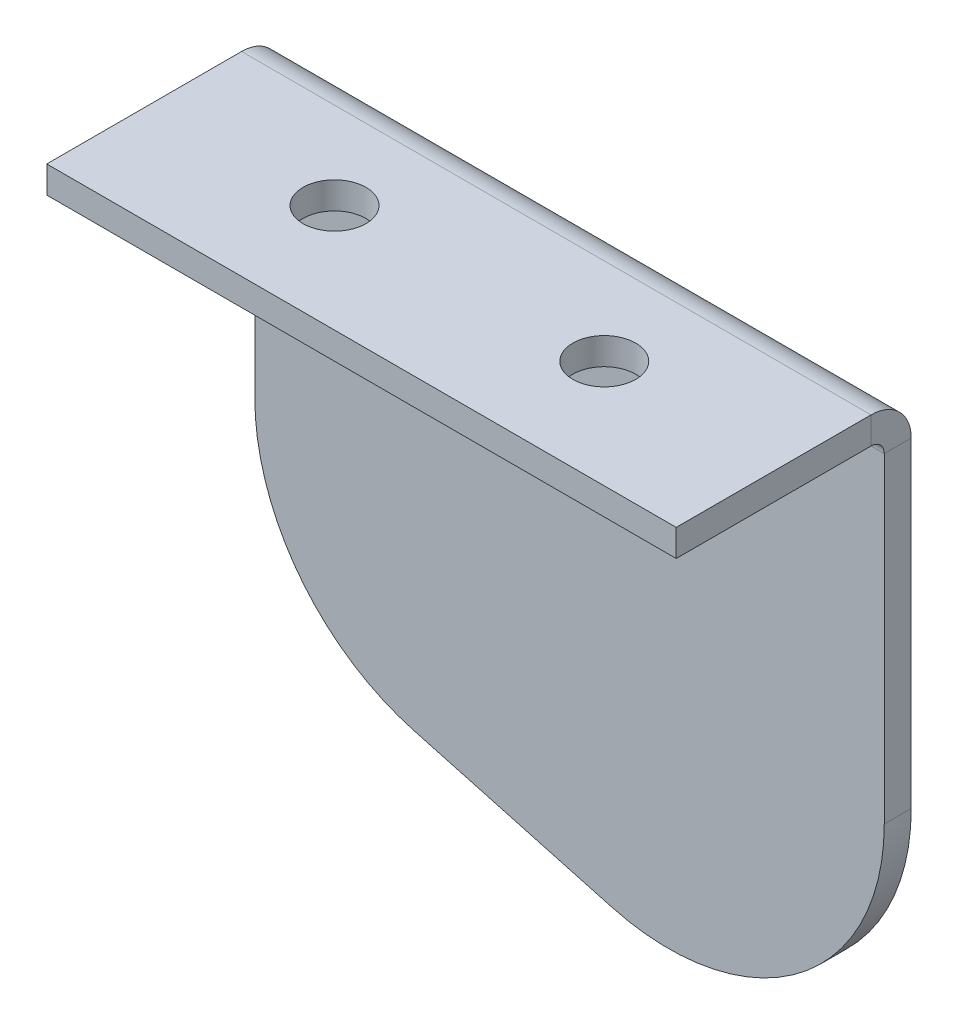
ISO-10303-21;
HEADER;
FILE_DESCRIPTION(('STEP AP214'),'2;1');
FILE_NAME('part.step','',(''),(''),'','','');
FILE_SCHEMA(('AUTOMOTIVE_DESIGN { 1 0 10303 214 1 1 1 1 }'));
ENDSEC;
DATA;
#1=APPLICATION_CONTEXT('core data for automotive mechanical design processes');
#2=APPLICATION_PROTOCOL_DEFINITION('international standard','automotive_design',2000,#1);
#3=PRODUCT_CONTEXT('',#1,'mechanical');
#4=PRODUCT('Part','Part','',(#3));
#5=PRODUCT_RELATED_PRODUCT_CATEGORY('part','',(#4));
#6=PRODUCT_DEFINITION_FORMATION('','',#4);
#7=PRODUCT_DEFINITION_CONTEXT('part definition',#1,'design');
#8=PRODUCT_DEFINITION('design','',#6,#7);
#9=PRODUCT_DEFINITION_SHAPE('','',#8);
#10=(LENGTH_UNIT() NAMED_UNIT(*) SI_UNIT(.MILLI.,.METRE.));
#11=(NAMED_UNIT(*) PLANE_ANGLE_UNIT() SI_UNIT($,.RADIAN.));
#12=(NAMED_UNIT(*) SI_UNIT($,.STERADIAN.) SOLID_ANGLE_UNIT());
#13=UNCERTAINTY_MEASURE_WITH_UNIT(LENGTH_MEASURE(1.E-05),#10,'distance_accuracy_value','');
#14=(GEOMETRIC_REPRESENTATION_CONTEXT(3) GLOBAL_UNCERTAINTY_ASSIGNED_CONTEXT((#13)) GLOBAL_UNIT_ASSIGNED_CONTEXT((#10,
#11,#12)) REPRESENTATION_CONTEXT('',''));
#15=CARTESIAN_POINT('',(0.,0.,0.));
#16=DIRECTION('',(0.,0.,1.));
#17=DIRECTION('',(1.,0.,0.));
#18=AXIS2_PLACEMENT_3D('',#15,#16,#17);
#19=CARTESIAN_POINT('',(35.,12.4309729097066,-13.0690270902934));
#20=DIRECTION('',(-1.,0.,0.));
#21=DIRECTION('',(0.,1.,0.));
#22=AXIS2_PLACEMENT_3D('',#19,#20,#21);
#23=PLANE('',#22);
#24=DIRECTION('',(0.,-1.,0.));
#25=VECTOR('',#24,1.);
#26=CARTESIAN_POINT('',(35.,12.4309729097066,-13.0690270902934));
#27=LINE('',#26,#25);
#28=CARTESIAN_POINT('',(35.,-0.736600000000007,-13.0690270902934));
#29=VERTEX_POINT('',#28);
#30=CARTESIAN_POINT('',(35.,-18.5690270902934,-13.0690270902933));
#31=VERTEX_POINT('',#30);
#32=EDGE_CURVE('E51',#29,#31,#27,.T.);
#33=ORIENTED_EDGE('',*,*,#32,.F.);
#34=DIRECTION('',(0.,0.,1.));
#35=VECTOR('',#34,1.);
#36=CARTESIAN_POINT('',(35.,-0.736600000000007,-13.0690270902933));
#37=LINE('',#36,#35);
#38=CARTESIAN_POINT('',(35.,-0.736600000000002,-11.5690270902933));
#39=VERTEX_POINT('',#38);
#40=EDGE_CURVE('E14',#29,#39,#37,.T.);
#41=ORIENTED_EDGE('',*,*,#40,.T.);
#42=DIRECTION('',(0.,-1.,0.));
#43=VECTOR('',#42,1.);
#44=CARTESIAN_POINT('',(35.,12.4309729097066,-11.5690270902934));
#45=LINE('',#44,#43);
#46=CARTESIAN_POINT('',(35.,-18.5690270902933,-11.5690270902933));
#47=VERTEX_POINT('',#46);
#48=EDGE_CURVE('E64',#39,#47,#45,.T.);
#49=ORIENTED_EDGE('',*,*,#48,.T.);
#50=DIRECTION('',(0.,0.,1.));
#51=VECTOR('',#50,1.);
#52=CARTESIAN_POINT('',(35.,-18.5690270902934,-13.0690270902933));
#53=LINE('',#52,#51);
#54=EDGE_CURVE('E215',#31,#47,#53,.T.);
#55=ORIENTED_EDGE('',*,*,#54,.F.);
#56=EDGE_LOOP('',(#33,#41,#49,#55));
#57=FACE_BOUND('',#56,.T.);
#58=ADVANCED_FACE('F48',(#57),#23,.F.);
#59=CARTESIAN_POINT('',(0.,-15.5690270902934,-13.0690270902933));
#60=DIRECTION('',(1.,0.,0.));
#61=DIRECTION('',(0.,-1.,0.));
#62=AXIS2_PLACEMENT_3D('',#59,#60,#61);
#63=PLANE('',#62);
#64=DIRECTION('',(0.,1.,0.));
#65=VECTOR('',#64,1.);
#66=CARTESIAN_POINT('',(0.,-15.5690270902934,-11.5690270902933));
#67=LINE('',#66,#65);
#68=CARTESIAN_POINT('',(0.,-15.5690270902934,-11.5690270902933));
#69=VERTEX_POINT('',#68);
#70=CARTESIAN_POINT('',(0.,-0.736600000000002,-11.5690270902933));
#71=VERTEX_POINT('',#70);
#72=EDGE_CURVE('E71',#69,#71,#67,.T.);
#73=ORIENTED_EDGE('',*,*,#72,.T.);
#74=DIRECTION('',(0.,0.,-1.));
#75=VECTOR('',#74,1.);
#76=CARTESIAN_POINT('',(0.,-0.736600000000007,-13.0690270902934));
#77=LINE('',#76,#75);
#78=CARTESIAN_POINT('',(0.,-0.736600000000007,-13.069027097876));
#79=VERTEX_POINT('',#78);
#80=EDGE_CURVE('E221',#71,#79,#77,.T.);
#81=ORIENTED_EDGE('',*,*,#80,.T.);
#82=DIRECTION('',(0.,1.,0.));
#83=VECTOR('',#82,1.);
#84=CARTESIAN_POINT('',(0.,-15.5690270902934,-13.0690270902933));
#85=LINE('',#84,#83);
#86=CARTESIAN_POINT('',(0.,-15.5690270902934,-13.0690270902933));
#87=VERTEX_POINT('',#86);
#88=EDGE_CURVE('E204',#87,#79,#85,.T.);
#89=ORIENTED_EDGE('',*,*,#88,.F.);
#90=DIRECTION('',(0.,0.,1.));
#91=VECTOR('',#90,1.);
#92=CARTESIAN_POINT('',(0.,-15.5690270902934,-13.0690270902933));
#93=LINE('',#92,#91);
#94=EDGE_CURVE('E218',#87,#69,#93,.T.);
#95=ORIENTED_EDGE('',*,*,#94,.T.);
#96=EDGE_LOOP('',(#73,#81,#89,#95));
#97=FACE_BOUND('',#96,.T.);
#98=ADVANCED_FACE('F246',(#97),#63,.F.);
#99=CARTESIAN_POINT('',(12.,-15.5690270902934,-11.5690270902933));
#100=DIRECTION('',(0.,0.,-1.));
#101=DIRECTION('',(0.,1.,0.));
#102=AXIS2_PLACEMENT_3D('',#99,#100,#101);
#103=PLANE('',#102);
#104=ORIENTED_EDGE('',*,*,#48,.F.);
#105=DIRECTION('',(-1.,0.,0.));
#106=VECTOR('',#105,1.);
#107=CARTESIAN_POINT('',(12.,-0.736600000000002,-11.5690270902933));
#108=LINE('',#107,#106);
#109=EDGE_CURVE('E56',#39,#71,#108,.T.);
#110=ORIENTED_EDGE('',*,*,#109,.T.);
#111=ORIENTED_EDGE('',*,*,#72,.F.);
#112=CARTESIAN_POINT('',(12.,-15.5690270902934,-11.5690270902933));
#113=DIRECTION('',(0.,0.,-1.));
#114=DIRECTION('',(0.,1.,0.));
#115=AXIS2_PLACEMENT_3D('',#112,#113,#114);
#116=CIRCLE('',#115,12.);
#117=CARTESIAN_POINT('',(8.8425911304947,-27.1461929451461,-11.5690270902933));
#118=VERTEX_POINT('',#117);
#119=EDGE_CURVE('E172',#118,#69,#116,.T.);
#120=ORIENTED_EDGE('',*,*,#119,.F.);
#121=DIRECTION('',(-0.964763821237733,0.263117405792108,0.));
#122=VECTOR('',#121,1.);
#123=CARTESIAN_POINT('',(8.8425911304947,-27.1461929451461,-11.5690270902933));
#124=LINE('',#123,#122);
#125=CARTESIAN_POINT('',(19.8425911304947,-30.1461929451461,-11.5690270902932));
#126=VERTEX_POINT('',#125);
#127=EDGE_CURVE('E199',#126,#118,#124,.T.);
#128=ORIENTED_EDGE('',*,*,#127,.F.);
#129=CARTESIAN_POINT('',(23.,-18.5690270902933,-11.5690270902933));
#130=DIRECTION('',(0.,0.,-1.));
#131=DIRECTION('',(0.,1.,0.));
#132=AXIS2_PLACEMENT_3D('',#129,#130,#131);
#133=CIRCLE('',#132,12.);
#134=EDGE_CURVE('E197',#47,#126,#133,.T.);
#135=ORIENTED_EDGE('',*,*,#134,.F.);
#136=EDGE_LOOP('',(#104,#110,#111,#120,#128,#135));
#137=FACE_BOUND('',#136,.T.);
#138=ADVANCED_FACE('F283',(#137),#103,.F.);
#139=CARTESIAN_POINT('',(12.,-15.5690270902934,-13.0690270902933));
#140=DIRECTION('',(0.,0.,-1.));
#141=DIRECTION('',(0.,1.,0.));
#142=AXIS2_PLACEMENT_3D('',#139,#140,#141);
#143=PLANE('',#142);
#144=DIRECTION('',(-1.,0.,0.));
#145=VECTOR('',#144,1.);
#146=CARTESIAN_POINT('',(12.,-0.736600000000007,-13.0690270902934));
#147=LINE('',#146,#145);
#148=EDGE_CURVE('E161',#29,#79,#147,.T.);
#149=ORIENTED_EDGE('',*,*,#148,.F.);
#150=ORIENTED_EDGE('',*,*,#32,.T.);
#151=CARTESIAN_POINT('',(23.,-18.5690270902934,-13.0690270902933));
#152=DIRECTION('',(0.,0.,-1.));
#153=DIRECTION('',(0.,1.,0.));
#154=AXIS2_PLACEMENT_3D('',#151,#152,#153);
#155=CIRCLE('',#154,12.);
#156=CARTESIAN_POINT('',(19.8425911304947,-30.1461929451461,-13.0690270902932));
#157=VERTEX_POINT('',#156);
#158=EDGE_CURVE('E205',#31,#157,#155,.T.);
#159=ORIENTED_EDGE('',*,*,#158,.T.);
#160=DIRECTION('',(-0.964763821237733,0.263117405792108,0.));
#161=VECTOR('',#160,1.);
#162=CARTESIAN_POINT('',(8.8425911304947,-27.1461929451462,-13.0690270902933));
#163=LINE('',#162,#161);
#164=CARTESIAN_POINT('',(8.8425911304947,-27.1461929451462,-13.0690270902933));
#165=VERTEX_POINT('',#164);
#166=EDGE_CURVE('E207',#157,#165,#163,.T.);
#167=ORIENTED_EDGE('',*,*,#166,.T.);
#168=CARTESIAN_POINT('',(12.,-15.5690270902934,-13.0690270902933));
#169=DIRECTION('',(0.,0.,-1.));
#170=DIRECTION('',(0.,1.,0.));
#171=AXIS2_PLACEMENT_3D('',#168,#169,#170);
#172=CIRCLE('',#171,12.);
#173=EDGE_CURVE('E201',#165,#87,#172,.T.);
#174=ORIENTED_EDGE('',*,*,#173,.T.);
#175=ORIENTED_EDGE('',*,*,#88,.T.);
#176=EDGE_LOOP('',(#149,#150,#159,#167,#174,#175));
#177=FACE_BOUND('',#176,.T.);
#178=ADVANCED_FACE('F229',(#177),#143,.T.);
#179=CARTESIAN_POINT('',(12.,-15.5690270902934,-13.0690270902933));
#180=DIRECTION('',(0.,0.,1.));
#181=DIRECTION('',(0.,-1.,0.));
#182=AXIS2_PLACEMENT_3D('',#179,#180,#181);
#183=CYLINDRICAL_SURFACE('',#182,12.);
#184=ORIENTED_EDGE('',*,*,#119,.T.);
#185=ORIENTED_EDGE('',*,*,#94,.F.);
#186=ORIENTED_EDGE('',*,*,#173,.F.);
#187=DIRECTION('',(0.,0.,1.));
#188=VECTOR('',#187,1.);
#189=CARTESIAN_POINT('',(8.8425911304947,-27.1461929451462,-13.0690270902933));
#190=LINE('',#189,#188);
#191=EDGE_CURVE('E209',#165,#118,#190,.T.);
#192=ORIENTED_EDGE('',*,*,#191,.T.);
#193=EDGE_LOOP('',(#184,#185,#186,#192));
#194=FACE_BOUND('',#193,.T.);
#195=ADVANCED_FACE('F244',(#194),#183,.T.);
#196=CARTESIAN_POINT('',(23.,-18.5690270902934,-13.0690270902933));
#197=DIRECTION('',(0.,0.,1.));
#198=DIRECTION('',(0.,-1.,0.));
#199=AXIS2_PLACEMENT_3D('',#196,#197,#198);
#200=CYLINDRICAL_SURFACE('',#199,12.);
#201=ORIENTED_EDGE('',*,*,#134,.T.);
#202=DIRECTION('',(0.,0.,1.));
#203=VECTOR('',#202,1.);
#204=CARTESIAN_POINT('',(19.8425911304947,-30.1461929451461,-13.0690270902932));
#205=LINE('',#204,#203);
#206=EDGE_CURVE('E212',#157,#126,#205,.T.);
#207=ORIENTED_EDGE('',*,*,#206,.F.);
#208=ORIENTED_EDGE('',*,*,#158,.F.);
#209=ORIENTED_EDGE('',*,*,#54,.T.);
#210=EDGE_LOOP('',(#201,#207,#208,#209));
#211=FACE_BOUND('',#210,.T.);
#212=ADVANCED_FACE('F235',(#211),#200,.T.);
#213=CARTESIAN_POINT('',(8.8425911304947,-27.1461929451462,-13.0690270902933));
#214=DIRECTION('',(0.263117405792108,0.964763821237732,0.));
#215=DIRECTION('',(0.964763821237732,-0.263117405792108,0.));
#216=AXIS2_PLACEMENT_3D('',#213,#214,#215);
#217=PLANE('',#216);
#218=ORIENTED_EDGE('',*,*,#127,.T.);
#219=ORIENTED_EDGE('',*,*,#191,.F.);
#220=ORIENTED_EDGE('',*,*,#166,.F.);
#221=ORIENTED_EDGE('',*,*,#206,.T.);
#222=EDGE_LOOP('',(#218,#219,#220,#221));
#223=FACE_BOUND('',#222,.T.);
#224=ADVANCED_FACE('F240',(#223),#217,.F.);
#225=CARTESIAN_POINT('',(0.,1.5,0.));
#226=DIRECTION('',(0.,0.,-1.));
#227=DIRECTION('',(-1.,0.,0.));
#228=AXIS2_PLACEMENT_3D('',#225,#226,#227);
#229=PLANE('',#228);
#230=DIRECTION('',(1.,0.,0.));
#231=VECTOR('',#230,1.);
#232=CARTESIAN_POINT('',(0.,0.,0.));
#233=LINE('',#232,#231);
#234=CARTESIAN_POINT('',(0.,0.,0.));
#235=VERTEX_POINT('',#234);
#236=CARTESIAN_POINT('',(35.,0.,0.));
#237=VERTEX_POINT('',#236);
#238=EDGE_CURVE('E156',#235,#237,#233,.T.);
#239=ORIENTED_EDGE('',*,*,#238,.T.);
#240=DIRECTION('',(0.,-1.,0.));
#241=VECTOR('',#240,1.);
#242=CARTESIAN_POINT('',(35.,1.5,0.));
#243=LINE('',#242,#241);
#244=CARTESIAN_POINT('',(35.,1.5,0.));
#245=VERTEX_POINT('',#244);
#246=EDGE_CURVE('E173',#245,#237,#243,.T.);
#247=ORIENTED_EDGE('',*,*,#246,.F.);
#248=DIRECTION('',(1.,0.,0.));
#249=VECTOR('',#248,1.);
#250=CARTESIAN_POINT('',(0.,1.5,0.));
#251=LINE('',#250,#249);
#252=CARTESIAN_POINT('',(0.,1.5,0.));
#253=VERTEX_POINT('',#252);
#254=EDGE_CURVE('E135',#253,#245,#251,.T.);
#255=ORIENTED_EDGE('',*,*,#254,.F.);
#256=DIRECTION('',(0.,-1.,0.));
#257=VECTOR('',#256,1.);
#258=CARTESIAN_POINT('',(0.,1.5,0.));
#259=LINE('',#258,#257);
#260=EDGE_CURVE('E132',#253,#235,#259,.T.);
#261=ORIENTED_EDGE('',*,*,#260,.T.);
#262=EDGE_LOOP('',(#239,#247,#255,#261));
#263=FACE_BOUND('',#262,.T.);
#264=ADVANCED_FACE('F266',(#263),#229,.F.);
#265=CARTESIAN_POINT('',(10.,1.5,-6.));
#266=DIRECTION('',(0.,-1.,0.));
#267=DIRECTION('',(0.,0.,-1.));
#268=AXIS2_PLACEMENT_3D('',#265,#266,#267);
#269=CYLINDRICAL_SURFACE('',#268,1.75);
#270=CARTESIAN_POINT('',(10.,1.5,-6.));
#271=DIRECTION('',(0.,1.,0.));
#272=DIRECTION('',(0.,0.,1.));
#273=AXIS2_PLACEMENT_3D('',#270,#271,#272);
#274=CIRCLE('',#273,1.75);
#275=CARTESIAN_POINT('',(10.,1.5,-4.25));
#276=VERTEX_POINT('',#275);
#277=EDGE_CURVE('E189',#276,#276,#274,.T.);
#278=ORIENTED_EDGE('',*,*,#277,.T.);
#279=EDGE_LOOP('',(#278));
#280=FACE_BOUND('',#279,.T.);
#281=CARTESIAN_POINT('',(10.,0.,-6.));
#282=DIRECTION('',(0.,1.,0.));
#283=DIRECTION('',(0.,0.,1.));
#284=AXIS2_PLACEMENT_3D('',#281,#282,#283);
#285=CIRCLE('',#284,1.75);
#286=CARTESIAN_POINT('',(10.,0.,-4.25));
#287=VERTEX_POINT('',#286);
#288=EDGE_CURVE('E176',#287,#287,#285,.T.);
#289=ORIENTED_EDGE('',*,*,#288,.F.);
#290=EDGE_LOOP('',(#289));
#291=FACE_BOUND('',#290,.T.);
#292=ADVANCED_FACE('F268',(#280,#291),#269,.F.);
#293=CARTESIAN_POINT('',(25.,1.5,-6.));
#294=DIRECTION('',(0.,-1.,0.));
#295=DIRECTION('',(0.,0.,-1.));
#296=AXIS2_PLACEMENT_3D('',#293,#294,#295);
#297=CYLINDRICAL_SURFACE('',#296,1.75);
#298=CARTESIAN_POINT('',(25.,1.5,-6.));
#299=DIRECTION('',(0.,1.,0.));
#300=DIRECTION('',(0.,0.,1.));
#301=AXIS2_PLACEMENT_3D('',#298,#299,#300);
#302=CIRCLE('',#301,1.75);
#303=CARTESIAN_POINT('',(25.,1.5,-4.25));
#304=VERTEX_POINT('',#303);
#305=EDGE_CURVE('E186',#304,#304,#302,.T.);
#306=ORIENTED_EDGE('',*,*,#305,.T.);
#307=EDGE_LOOP('',(#306));
#308=FACE_BOUND('',#307,.T.);
#309=CARTESIAN_POINT('',(25.,0.,-6.));
#310=DIRECTION('',(0.,1.,0.));
#311=DIRECTION('',(0.,0.,1.));
#312=AXIS2_PLACEMENT_3D('',#309,#310,#311);
#313=CIRCLE('',#312,1.75);
#314=CARTESIAN_POINT('',(25.,0.,-4.25));
#315=VERTEX_POINT('',#314);
#316=EDGE_CURVE('E179',#315,#315,#313,.T.);
#317=ORIENTED_EDGE('',*,*,#316,.F.);
#318=EDGE_LOOP('',(#317));
#319=FACE_BOUND('',#318,.T.);
#320=ADVANCED_FACE('F274',(#308,#319),#297,.F.);
#321=CARTESIAN_POINT('',(12.,1.5,-28.));
#322=DIRECTION('',(0.,1.,0.));
#323=DIRECTION('',(0.,0.,1.));
#324=AXIS2_PLACEMENT_3D('',#321,#322,#323);
#325=PLANE('',#324);
#326=ORIENTED_EDGE('',*,*,#305,.F.);
#327=EDGE_LOOP('',(#326));
#328=FACE_BOUND('',#327,.T.);
#329=ORIENTED_EDGE('',*,*,#277,.F.);
#330=EDGE_LOOP('',(#329));
#331=FACE_BOUND('',#330,.T.);
#332=DIRECTION('',(0.,0.,-1.));
#333=VECTOR('',#332,1.);
#334=CARTESIAN_POINT('',(35.,1.5,0.));
#335=LINE('',#334,#333);
#336=CARTESIAN_POINT('',(35.,1.5,-10.8324270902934));
#337=VERTEX_POINT('',#336);
#338=EDGE_CURVE('E141',#245,#337,#335,.T.);
#339=ORIENTED_EDGE('',*,*,#338,.T.);
#340=DIRECTION('',(-1.,0.,0.));
#341=VECTOR('',#340,1.);
#342=CARTESIAN_POINT('',(12.,1.5,-10.8324270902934));
#343=LINE('',#342,#341);
#344=CARTESIAN_POINT('',(0.,1.50000000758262,-10.8324270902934));
#345=VERTEX_POINT('',#344);
#346=EDGE_CURVE('E136',#337,#345,#343,.T.);
#347=ORIENTED_EDGE('',*,*,#346,.T.);
#348=DIRECTION('',(0.,0.,1.));
#349=VECTOR('',#348,1.);
#350=CARTESIAN_POINT('',(0.,1.5,-28.));
#351=LINE('',#350,#349);
#352=EDGE_CURVE('E125',#345,#253,#351,.T.);
#353=ORIENTED_EDGE('',*,*,#352,.T.);
#354=ORIENTED_EDGE('',*,*,#254,.T.);
#355=EDGE_LOOP('',(#339,#347,#353,#354));
#356=FACE_BOUND('',#355,.T.);
#357=ADVANCED_FACE('F139',(#328,#331,#356),#325,.T.);
#358=CARTESIAN_POINT('',(0.,1.5,-28.));
#359=DIRECTION('',(1.,0.,0.));
#360=DIRECTION('',(0.,0.,-1.));
#361=AXIS2_PLACEMENT_3D('',#358,#359,#360);
#362=PLANE('',#361);
#363=DIRECTION('',(0.,1.,0.));
#364=VECTOR('',#363,1.);
#365=CARTESIAN_POINT('',(0.,1.5,-10.8324270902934));
#366=LINE('',#365,#364);
#367=CARTESIAN_POINT('',(0.,0.,-10.8324270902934));
#368=VERTEX_POINT('',#367);
#369=EDGE_CURVE('E129',#368,#345,#366,.T.);
#370=ORIENTED_EDGE('',*,*,#369,.F.);
#371=DIRECTION('',(0.,0.,1.));
#372=VECTOR('',#371,1.);
#373=CARTESIAN_POINT('',(0.,0.,-28.));
#374=LINE('',#373,#372);
#375=EDGE_CURVE('E182',#368,#235,#374,.T.);
#376=ORIENTED_EDGE('',*,*,#375,.T.);
#377=ORIENTED_EDGE('',*,*,#260,.F.);
#378=ORIENTED_EDGE('',*,*,#352,.F.);
#379=EDGE_LOOP('',(#370,#376,#377,#378));
#380=FACE_BOUND('',#379,.T.);
#381=ADVANCED_FACE('F127',(#380),#362,.F.);
#382=CARTESIAN_POINT('',(12.,0.,-28.));
#383=DIRECTION('',(0.,1.,0.));
#384=DIRECTION('',(0.,0.,1.));
#385=AXIS2_PLACEMENT_3D('',#382,#383,#384);
#386=PLANE('',#385);
#387=DIRECTION('',(-1.,0.,0.));
#388=VECTOR('',#387,1.);
#389=CARTESIAN_POINT('',(12.,0.,-10.8324270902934));
#390=LINE('',#389,#388);
#391=CARTESIAN_POINT('',(35.,0.,-10.8324270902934));
#392=VERTEX_POINT('',#391);
#393=EDGE_CURVE('E157',#392,#368,#390,.T.);
#394=ORIENTED_EDGE('',*,*,#393,.F.);
#395=DIRECTION('',(0.,0.,-1.));
#396=VECTOR('',#395,1.);
#397=CARTESIAN_POINT('',(35.,0.,0.));
#398=LINE('',#397,#396);
#399=EDGE_CURVE('E170',#237,#392,#398,.T.);
#400=ORIENTED_EDGE('',*,*,#399,.F.);
#401=ORIENTED_EDGE('',*,*,#238,.F.);
#402=ORIENTED_EDGE('',*,*,#375,.F.);
#403=EDGE_LOOP('',(#394,#400,#401,#402));
#404=FACE_BOUND('',#403,.T.);
#405=ORIENTED_EDGE('',*,*,#316,.T.);
#406=EDGE_LOOP('',(#405));
#407=FACE_BOUND('',#406,.T.);
#408=ORIENTED_EDGE('',*,*,#288,.T.);
#409=EDGE_LOOP('',(#408));
#410=FACE_BOUND('',#409,.T.);
#411=ADVANCED_FACE('F263',(#404,#407,#410),#386,.F.);
#412=CARTESIAN_POINT('',(35.,1.5,0.));
#413=DIRECTION('',(-1.,0.,0.));
#414=DIRECTION('',(0.,0.,1.));
#415=AXIS2_PLACEMENT_3D('',#412,#413,#414);
#416=PLANE('',#415);
#417=DIRECTION('',(0.,-1.,0.));
#418=VECTOR('',#417,1.);
#419=CARTESIAN_POINT('',(35.,1.5,-10.8324270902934));
#420=LINE('',#419,#418);
#421=EDGE_CURVE('E162',#337,#392,#420,.T.);
#422=ORIENTED_EDGE('',*,*,#421,.F.);
#423=ORIENTED_EDGE('',*,*,#338,.F.);
#424=ORIENTED_EDGE('',*,*,#246,.T.);
#425=ORIENTED_EDGE('',*,*,#399,.T.);
#426=EDGE_LOOP('',(#422,#423,#424,#425));
#427=FACE_BOUND('',#426,.T.);
#428=ADVANCED_FACE('F258',(#427),#416,.F.);
#429=CARTESIAN_POINT('',(35.,-0.736600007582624,-10.8324270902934));
#430=DIRECTION('',(1.,0.,0.));
#431=DIRECTION('',(0.,0.,-1.));
#432=AXIS2_PLACEMENT_3D('',#429,#430,#431);
#433=PLANE('',#432);
#434=ORIENTED_EDGE('',*,*,#421,.T.);
#435=CARTESIAN_POINT('',(35.,-0.7366,-10.8324270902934));
#436=DIRECTION('',(-1.,0.,0.));
#437=DIRECTION('',(0.,0.,1.));
#438=AXIS2_PLACEMENT_3D('',#435,#436,#437);
#439=CIRCLE('',#438,0.736600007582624);
#440=EDGE_CURVE('E253',#392,#39,#439,.T.);
#441=ORIENTED_EDGE('',*,*,#440,.T.);
#442=ORIENTED_EDGE('',*,*,#40,.F.);
#443=CARTESIAN_POINT('',(35.,-0.736600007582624,-10.8324270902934));
#444=DIRECTION('',(-1.,0.,0.));
#445=DIRECTION('',(0.,0.,1.));
#446=AXIS2_PLACEMENT_3D('',#443,#444,#445);
#447=CIRCLE('',#446,2.23660001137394);
#448=EDGE_CURVE('E163',#337,#29,#447,.T.);
#449=ORIENTED_EDGE('',*,*,#448,.F.);
#450=EDGE_LOOP('',(#434,#441,#442,#449));
#451=FACE_BOUND('',#450,.T.);
#452=ADVANCED_FACE('F256',(#451),#433,.T.);
#453=CARTESIAN_POINT('',(0.,-0.736600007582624,-10.8324270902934));
#454=DIRECTION('',(-1.,0.,0.));
#455=DIRECTION('',(0.,0.,1.));
#456=AXIS2_PLACEMENT_3D('',#453,#454,#455);
#457=PLANE('',#456);
#458=CARTESIAN_POINT('',(0.,-0.7366,-10.8324270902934));
#459=DIRECTION('',(-1.,0.,0.));
#460=DIRECTION('',(0.,0.,1.));
#461=AXIS2_PLACEMENT_3D('',#458,#459,#460);
#462=CIRCLE('',#461,0.736600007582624);
#463=EDGE_CURVE('E155',#71,#368,#462,.F.);
#464=ORIENTED_EDGE('',*,*,#463,.T.);
#465=ORIENTED_EDGE('',*,*,#369,.T.);
#466=CARTESIAN_POINT('',(0.,-0.736600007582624,-10.8324270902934));
#467=DIRECTION('',(1.,0.,0.));
#468=DIRECTION('',(0.,0.,-1.));
#469=AXIS2_PLACEMENT_3D('',#466,#467,#468);
#470=CIRCLE('',#469,2.23660001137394);
#471=EDGE_CURVE('E153',#79,#345,#470,.T.);
#472=ORIENTED_EDGE('',*,*,#471,.F.);
#473=ORIENTED_EDGE('',*,*,#80,.F.);
#474=EDGE_LOOP('',(#464,#465,#472,#473));
#475=FACE_BOUND('',#474,.T.);
#476=ADVANCED_FACE('F151',(#475),#457,.T.);
#477=CARTESIAN_POINT('',(52.6098690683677,-0.7366,-10.8324270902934));
#478=DIRECTION('',(-1.,0.,0.));
#479=DIRECTION('',(0.,0.,1.));
#480=AXIS2_PLACEMENT_3D('',#477,#478,#479);
#481=CYLINDRICAL_SURFACE('',#480,2.23660000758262);
#482=ORIENTED_EDGE('',*,*,#148,.T.);
#483=ORIENTED_EDGE('',*,*,#471,.T.);
#484=ORIENTED_EDGE('',*,*,#346,.F.);
#485=ORIENTED_EDGE('',*,*,#448,.T.);
#486=EDGE_LOOP('',(#482,#483,#484,#485));
#487=FACE_BOUND('',#486,.T.);
#488=ADVANCED_FACE('F160',(#487),#481,.T.);
#489=CARTESIAN_POINT('',(52.6098690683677,-0.7366,-10.8324270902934));
#490=DIRECTION('',(-1.,0.,0.));
#491=DIRECTION('',(0.,0.,1.));
#492=AXIS2_PLACEMENT_3D('',#489,#490,#491);
#493=CYLINDRICAL_SURFACE('',#492,0.736600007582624);
#494=ORIENTED_EDGE('',*,*,#109,.F.);
#495=ORIENTED_EDGE('',*,*,#440,.F.);
#496=ORIENTED_EDGE('',*,*,#393,.T.);
#497=ORIENTED_EDGE('',*,*,#463,.F.);
#498=EDGE_LOOP('',(#494,#495,#496,#497));
#499=FACE_BOUND('',#498,.T.);
#500=ADVANCED_FACE('F249',(#499),#493,.F.);
#501=CLOSED_SHELL('',(#58,#98,#138,#178,#195,#212,#224,#264,#292,#320,#357,#381,#411,#428,#452,
#476,#488,#500));
#502=MANIFOLD_SOLID_BREP('B2',#501);
#503=ADVANCED_BREP_SHAPE_REPRESENTATION('',(#18,#502),#14);
#504=SHAPE_DEFINITION_REPRESENTATION(#9,#503);
ENDSEC;
END-ISO-10303-21;
